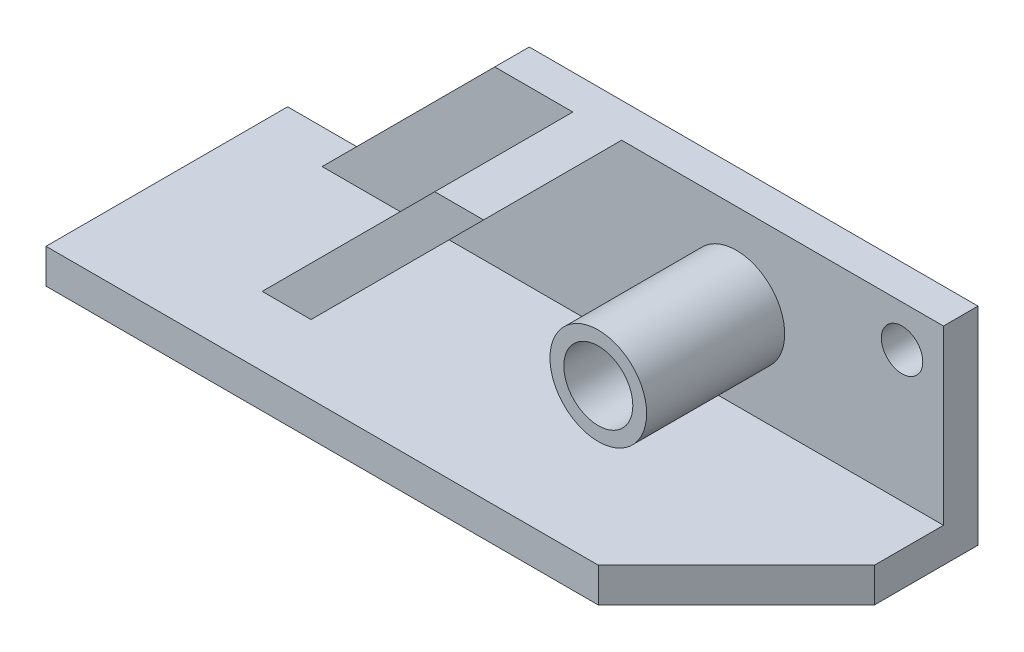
ISO-10303-21;
HEADER;
FILE_DESCRIPTION(('STEP AP214'),'2;1');
FILE_NAME('part.step','',(''),(''),'','','');
FILE_SCHEMA(('AUTOMOTIVE_DESIGN { 1 0 10303 214 1 1 1 1 }'));
ENDSEC;
DATA;
#1=APPLICATION_CONTEXT('core data for automotive mechanical design processes');
#2=APPLICATION_PROTOCOL_DEFINITION('international standard','automotive_design',2000,#1);
#3=PRODUCT_CONTEXT('',#1,'mechanical');
#4=PRODUCT('Part','Part','',(#3));
#5=PRODUCT_RELATED_PRODUCT_CATEGORY('part','',(#4));
#6=PRODUCT_DEFINITION_FORMATION('','',#4);
#7=PRODUCT_DEFINITION_CONTEXT('part definition',#1,'design');
#8=PRODUCT_DEFINITION('design','',#6,#7);
#9=PRODUCT_DEFINITION_SHAPE('','',#8);
#10=(LENGTH_UNIT() NAMED_UNIT(*) SI_UNIT(.MILLI.,.METRE.));
#11=(NAMED_UNIT(*) PLANE_ANGLE_UNIT() SI_UNIT($,.RADIAN.));
#12=(NAMED_UNIT(*) SI_UNIT($,.STERADIAN.) SOLID_ANGLE_UNIT());
#13=UNCERTAINTY_MEASURE_WITH_UNIT(LENGTH_MEASURE(1.E-05),#10,'distance_accuracy_value','');
#14=(GEOMETRIC_REPRESENTATION_CONTEXT(3) GLOBAL_UNCERTAINTY_ASSIGNED_CONTEXT((#13)) GLOBAL_UNIT_ASSIGNED_CONTEXT((#10,
#11,#12)) REPRESENTATION_CONTEXT('',''));
#15=CARTESIAN_POINT('',(0.,0.,0.));
#16=DIRECTION('',(0.,0.,1.));
#17=DIRECTION('',(1.,0.,0.));
#18=AXIS2_PLACEMENT_3D('',#15,#16,#17);
#19=CARTESIAN_POINT('',(100.,94.9999999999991,5.));
#20=DIRECTION('',(0.,0.,-1.));
#21=DIRECTION('',(-1.,0.,0.));
#22=AXIS2_PLACEMENT_3D('',#19,#20,#21);
#23=PLANE('',#22);
#24=CARTESIAN_POINT('',(94.,24.,5.));
#25=DIRECTION('',(0.,0.,1.));
#26=DIRECTION('',(1.,0.,0.));
#27=AXIS2_PLACEMENT_3D('',#24,#25,#26);
#28=CIRCLE('',#27,3.00000000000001);
#29=CARTESIAN_POINT('',(97.,24.,5.));
#30=VERTEX_POINT('',#29);
#31=EDGE_CURVE('E152',#30,#30,#28,.T.);
#32=ORIENTED_EDGE('',*,*,#31,.F.);
#33=EDGE_LOOP('',(#32));
#34=FACE_BOUND('',#33,.T.);
#35=DIRECTION('',(0.707106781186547,0.707106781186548,0.));
#36=VECTOR('',#35,1.);
#37=CARTESIAN_POINT('',(28.3847763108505,5.,5.));
#38=LINE('',#37,#36);
#39=CARTESIAN_POINT('',(28.3847763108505,5.,5.));
#40=VERTEX_POINT('',#39);
#41=CARTESIAN_POINT('',(53.3847763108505,30.,5.));
#42=VERTEX_POINT('',#41);
#43=EDGE_CURVE('E142',#40,#42,#38,.T.);
#44=ORIENTED_EDGE('',*,*,#43,.F.);
#45=DIRECTION('',(1.,0.,0.));
#46=VECTOR('',#45,1.);
#47=CARTESIAN_POINT('',(10.,5.,5.));
#48=LINE('',#47,#46);
#49=CARTESIAN_POINT('',(100.,5.,5.));
#50=VERTEX_POINT('',#49);
#51=EDGE_CURVE('E163',#40,#50,#48,.T.);
#52=ORIENTED_EDGE('',*,*,#51,.T.);
#53=DIRECTION('',(0.,1.,0.));
#54=VECTOR('',#53,1.);
#55=CARTESIAN_POINT('',(100.,5.,5.));
#56=LINE('',#55,#54);
#57=CARTESIAN_POINT('',(100.,30.,5.));
#58=VERTEX_POINT('',#57);
#59=EDGE_CURVE('E132',#50,#58,#56,.T.);
#60=ORIENTED_EDGE('',*,*,#59,.T.);
#61=DIRECTION('',(-1.,0.,0.));
#62=VECTOR('',#61,1.);
#63=CARTESIAN_POINT('',(100.,30.,5.));
#64=LINE('',#63,#62);
#65=EDGE_CURVE('E131',#58,#42,#64,.T.);
#66=ORIENTED_EDGE('',*,*,#65,.T.);
#67=EDGE_LOOP('',(#44,#52,#60,#66));
#68=FACE_BOUND('',#67,.T.);
#69=CARTESIAN_POINT('',(70.,17.5,5.));
#70=DIRECTION('',(0.,0.,-1.));
#71=DIRECTION('',(-1.,0.,0.));
#72=AXIS2_PLACEMENT_3D('',#69,#70,#71);
#73=CIRCLE('',#72,7.);
#74=CARTESIAN_POINT('',(63.,17.5,5.));
#75=VERTEX_POINT('',#74);
#76=EDGE_CURVE('E11',#75,#75,#73,.F.);
#77=ORIENTED_EDGE('',*,*,#76,.F.);
#78=EDGE_LOOP('',(#77));
#79=FACE_BOUND('',#78,.T.);
#80=ADVANCED_FACE('F33',(#34,#68,#79),#23,.F.);
#81=CARTESIAN_POINT('',(0.,5.,0.));
#82=DIRECTION('',(0.,-1.,0.));
#83=DIRECTION('',(0.,0.,-1.));
#84=AXIS2_PLACEMENT_3D('',#81,#82,#83);
#85=PLANE('',#84);
#86=DIRECTION('',(0.,0.,-1.));
#87=VECTOR('',#86,1.);
#88=CARTESIAN_POINT('',(21.313708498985,5.,25.));
#89=LINE('',#88,#87);
#90=CARTESIAN_POINT('',(21.313708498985,5.,25.));
#91=VERTEX_POINT('',#90);
#92=CARTESIAN_POINT('',(21.313708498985,5.,5.));
#93=VERTEX_POINT('',#92);
#94=EDGE_CURVE('E149',#91,#93,#89,.T.);
#95=ORIENTED_EDGE('',*,*,#94,.T.);
#96=CARTESIAN_POINT('',(10.,5.,5.));
#97=VERTEX_POINT('',#96);
#98=EDGE_CURVE('E139',#97,#93,#48,.T.);
#99=ORIENTED_EDGE('',*,*,#98,.F.);
#100=DIRECTION('',(0.,0.,-1.));
#101=VECTOR('',#100,1.);
#102=CARTESIAN_POINT('',(10.,5.,5.));
#103=LINE('',#102,#101);
#104=CARTESIAN_POINT('',(10.,5.,0.));
#105=VERTEX_POINT('',#104);
#106=EDGE_CURVE('E169',#97,#105,#103,.T.);
#107=ORIENTED_EDGE('',*,*,#106,.T.);
#108=DIRECTION('',(-1.,0.,0.));
#109=VECTOR('',#108,1.);
#110=CARTESIAN_POINT('',(0.,5.,0.));
#111=LINE('',#110,#109);
#112=CARTESIAN_POINT('',(0.,5.,0.));
#113=VERTEX_POINT('',#112);
#114=EDGE_CURVE('E202',#105,#113,#111,.T.);
#115=ORIENTED_EDGE('',*,*,#114,.T.);
#116=DIRECTION('',(0.,0.,1.));
#117=VECTOR('',#116,1.);
#118=CARTESIAN_POINT('',(0.,5.,35.));
#119=LINE('',#118,#117);
#120=CARTESIAN_POINT('',(0.,5.,35.));
#121=VERTEX_POINT('',#120);
#122=EDGE_CURVE('E247',#113,#121,#119,.T.);
#123=ORIENTED_EDGE('',*,*,#122,.T.);
#124=DIRECTION('',(1.,0.,0.));
#125=VECTOR('',#124,1.);
#126=CARTESIAN_POINT('',(80.,5.,35.));
#127=LINE('',#126,#125);
#128=CARTESIAN_POINT('',(80.,5.,35.));
#129=VERTEX_POINT('',#128);
#130=EDGE_CURVE('E206',#121,#129,#127,.T.);
#131=ORIENTED_EDGE('',*,*,#130,.T.);
#132=DIRECTION('',(0.707106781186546,0.,-0.707106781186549));
#133=VECTOR('',#132,1.);
#134=CARTESIAN_POINT('',(100.,5.,14.9999999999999));
#135=LINE('',#134,#133);
#136=CARTESIAN_POINT('',(100.,5.,14.9999999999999));
#137=VERTEX_POINT('',#136);
#138=EDGE_CURVE('E200',#129,#137,#135,.T.);
#139=ORIENTED_EDGE('',*,*,#138,.T.);
#140=DIRECTION('',(0.,0.,-1.));
#141=VECTOR('',#140,1.);
#142=CARTESIAN_POINT('',(100.,5.,0.));
#143=LINE('',#142,#141);
#144=EDGE_CURVE('E196',#137,#50,#143,.T.);
#145=ORIENTED_EDGE('',*,*,#144,.T.);
#146=ORIENTED_EDGE('',*,*,#51,.F.);
#147=DIRECTION('',(0.,0.,-1.));
#148=VECTOR('',#147,1.);
#149=CARTESIAN_POINT('',(28.3847763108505,5.,25.));
#150=LINE('',#149,#148);
#151=CARTESIAN_POINT('',(28.3847763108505,5.,25.));
#152=VERTEX_POINT('',#151);
#153=EDGE_CURVE('E48',#152,#40,#150,.T.);
#154=ORIENTED_EDGE('',*,*,#153,.F.);
#155=DIRECTION('',(1.,0.,0.));
#156=VECTOR('',#155,1.);
#157=CARTESIAN_POINT('',(21.313708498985,5.,25.));
#158=LINE('',#157,#156);
#159=EDGE_CURVE('E52',#91,#152,#158,.T.);
#160=ORIENTED_EDGE('',*,*,#159,.F.);
#161=EDGE_LOOP('',(#95,#99,#107,#115,#123,#131,#139,#145,#146,#154,#160));
#162=FACE_BOUND('',#161,.T.);
#163=ADVANCED_FACE('F198',(#162),#85,.F.);
#164=DIRECTION('',(-0.707106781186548,-0.707106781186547,0.));
#165=VECTOR('',#164,1.);
#166=CARTESIAN_POINT('',(46.313708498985,30.,5.));
#167=LINE('',#166,#165);
#168=CARTESIAN_POINT('',(46.313708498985,30.,5.));
#169=VERTEX_POINT('',#168);
#170=EDGE_CURVE('E136',#169,#93,#167,.T.);
#171=ORIENTED_EDGE('',*,*,#170,.F.);
#172=CARTESIAN_POINT('',(35.0000000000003,30.,5.));
#173=VERTEX_POINT('',#172);
#174=EDGE_CURVE('E121',#169,#173,#64,.T.);
#175=ORIENTED_EDGE('',*,*,#174,.T.);
#176=DIRECTION('',(-0.707106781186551,-0.707106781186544,0.));
#177=VECTOR('',#176,1.);
#178=CARTESIAN_POINT('',(35.0000000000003,30.,5.));
#179=LINE('',#178,#177);
#180=EDGE_CURVE('E162',#173,#97,#179,.T.);
#181=ORIENTED_EDGE('',*,*,#180,.T.);
#182=ORIENTED_EDGE('',*,*,#98,.T.);
#183=EDGE_LOOP('',(#171,#175,#181,#182));
#184=FACE_BOUND('',#183,.T.);
#185=ADVANCED_FACE('F137',(#184),#23,.F.);
#186=CARTESIAN_POINT('',(0.,5.,35.));
#187=DIRECTION('',(1.,0.,0.));
#188=DIRECTION('',(0.,0.,-1.));
#189=AXIS2_PLACEMENT_3D('',#186,#187,#188);
#190=PLANE('',#189);
#191=DIRECTION('',(0.,0.,1.));
#192=VECTOR('',#191,1.);
#193=CARTESIAN_POINT('',(0.,0.,35.));
#194=LINE('',#193,#192);
#195=CARTESIAN_POINT('',(0.,0.,0.));
#196=VERTEX_POINT('',#195);
#197=CARTESIAN_POINT('',(0.,0.,35.));
#198=VERTEX_POINT('',#197);
#199=EDGE_CURVE('E172',#196,#198,#194,.T.);
#200=ORIENTED_EDGE('',*,*,#199,.T.);
#201=DIRECTION('',(0.,-1.,0.));
#202=VECTOR('',#201,1.);
#203=CARTESIAN_POINT('',(0.,5.,35.));
#204=LINE('',#203,#202);
#205=EDGE_CURVE('E41',#121,#198,#204,.T.);
#206=ORIENTED_EDGE('',*,*,#205,.F.);
#207=ORIENTED_EDGE('',*,*,#122,.F.);
#208=DIRECTION('',(0.,-1.,0.));
#209=VECTOR('',#208,1.);
#210=CARTESIAN_POINT('',(0.,5.,0.));
#211=LINE('',#210,#209);
#212=EDGE_CURVE('E204',#113,#196,#211,.T.);
#213=ORIENTED_EDGE('',*,*,#212,.T.);
#214=EDGE_LOOP('',(#200,#206,#207,#213));
#215=FACE_BOUND('',#214,.T.);
#216=ADVANCED_FACE('F35',(#215),#190,.F.);
#217=CARTESIAN_POINT('',(80.,5.,35.));
#218=DIRECTION('',(0.,0.,-1.));
#219=DIRECTION('',(-1.,0.,0.));
#220=AXIS2_PLACEMENT_3D('',#217,#218,#219);
#221=PLANE('',#220);
#222=DIRECTION('',(1.,0.,0.));
#223=VECTOR('',#222,1.);
#224=CARTESIAN_POINT('',(80.,0.,35.));
#225=LINE('',#224,#223);
#226=CARTESIAN_POINT('',(80.,0.,35.));
#227=VERTEX_POINT('',#226);
#228=EDGE_CURVE('E232',#198,#227,#225,.T.);
#229=ORIENTED_EDGE('',*,*,#228,.T.);
#230=DIRECTION('',(0.,-1.,0.));
#231=VECTOR('',#230,1.);
#232=CARTESIAN_POINT('',(80.,5.,35.));
#233=LINE('',#232,#231);
#234=EDGE_CURVE('E222',#129,#227,#233,.T.);
#235=ORIENTED_EDGE('',*,*,#234,.F.);
#236=ORIENTED_EDGE('',*,*,#130,.F.);
#237=ORIENTED_EDGE('',*,*,#205,.T.);
#238=EDGE_LOOP('',(#229,#235,#236,#237));
#239=FACE_BOUND('',#238,.T.);
#240=ADVANCED_FACE('F231',(#239),#221,.F.);
#241=CARTESIAN_POINT('',(100.,5.,14.9999999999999));
#242=DIRECTION('',(-0.707106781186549,0.,-0.707106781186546));
#243=DIRECTION('',(-0.707106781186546,0.,0.707106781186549));
#244=AXIS2_PLACEMENT_3D('',#241,#242,#243);
#245=PLANE('',#244);
#246=DIRECTION('',(0.707106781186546,0.,-0.707106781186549));
#247=VECTOR('',#246,1.);
#248=CARTESIAN_POINT('',(100.,0.,14.9999999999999));
#249=LINE('',#248,#247);
#250=CARTESIAN_POINT('',(100.,0.,14.9999999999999));
#251=VERTEX_POINT('',#250);
#252=EDGE_CURVE('E240',#227,#251,#249,.T.);
#253=ORIENTED_EDGE('',*,*,#252,.T.);
#254=DIRECTION('',(0.,-1.,0.));
#255=VECTOR('',#254,1.);
#256=CARTESIAN_POINT('',(100.,5.,14.9999999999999));
#257=LINE('',#256,#255);
#258=EDGE_CURVE('E221',#137,#251,#257,.T.);
#259=ORIENTED_EDGE('',*,*,#258,.F.);
#260=ORIENTED_EDGE('',*,*,#138,.F.);
#261=ORIENTED_EDGE('',*,*,#234,.T.);
#262=EDGE_LOOP('',(#253,#259,#260,#261));
#263=FACE_BOUND('',#262,.T.);
#264=ADVANCED_FACE('F248',(#263),#245,.F.);
#265=CARTESIAN_POINT('',(100.,5.,0.));
#266=DIRECTION('',(-1.,0.,0.));
#267=DIRECTION('',(0.,0.,1.));
#268=AXIS2_PLACEMENT_3D('',#265,#266,#267);
#269=PLANE('',#268);
#270=DIRECTION('',(0.,0.,-1.));
#271=VECTOR('',#270,1.);
#272=CARTESIAN_POINT('',(100.,0.,0.));
#273=LINE('',#272,#271);
#274=CARTESIAN_POINT('',(100.,0.,0.));
#275=VERTEX_POINT('',#274);
#276=EDGE_CURVE('E241',#251,#275,#273,.T.);
#277=ORIENTED_EDGE('',*,*,#276,.T.);
#278=DIRECTION('',(0.,-1.,0.));
#279=VECTOR('',#278,1.);
#280=CARTESIAN_POINT('',(100.,5.,0.));
#281=LINE('',#280,#279);
#282=CARTESIAN_POINT('',(100.,30.,0.));
#283=VERTEX_POINT('',#282);
#284=EDGE_CURVE('E218',#283,#275,#281,.T.);
#285=ORIENTED_EDGE('',*,*,#284,.F.);
#286=DIRECTION('',(0.,0.,-1.));
#287=VECTOR('',#286,1.);
#288=CARTESIAN_POINT('',(100.,30.,5.));
#289=LINE('',#288,#287);
#290=EDGE_CURVE('E166',#58,#283,#289,.T.);
#291=ORIENTED_EDGE('',*,*,#290,.F.);
#292=ORIENTED_EDGE('',*,*,#59,.F.);
#293=ORIENTED_EDGE('',*,*,#144,.F.);
#294=ORIENTED_EDGE('',*,*,#258,.T.);
#295=EDGE_LOOP('',(#277,#285,#291,#292,#293,#294));
#296=FACE_BOUND('',#295,.T.);
#297=ADVANCED_FACE('F194',(#296),#269,.F.);
#298=CARTESIAN_POINT('',(0.,5.,0.));
#299=DIRECTION('',(0.,0.,1.));
#300=DIRECTION('',(1.,0.,0.));
#301=AXIS2_PLACEMENT_3D('',#298,#299,#300);
#302=PLANE('',#301);
#303=DIRECTION('',(-1.,0.,0.));
#304=VECTOR('',#303,1.);
#305=CARTESIAN_POINT('',(0.,0.,0.));
#306=LINE('',#305,#304);
#307=EDGE_CURVE('E245',#275,#196,#306,.T.);
#308=ORIENTED_EDGE('',*,*,#307,.T.);
#309=ORIENTED_EDGE('',*,*,#212,.F.);
#310=ORIENTED_EDGE('',*,*,#114,.F.);
#311=DIRECTION('',(-0.707106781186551,-0.707106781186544,0.));
#312=VECTOR('',#311,1.);
#313=CARTESIAN_POINT('',(35.0000000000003,30.,0.));
#314=LINE('',#313,#312);
#315=CARTESIAN_POINT('',(35.0000000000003,30.,0.));
#316=VERTEX_POINT('',#315);
#317=EDGE_CURVE('E159',#316,#105,#314,.T.);
#318=ORIENTED_EDGE('',*,*,#317,.F.);
#319=DIRECTION('',(-1.,0.,0.));
#320=VECTOR('',#319,1.);
#321=CARTESIAN_POINT('',(100.,30.,0.));
#322=LINE('',#321,#320);
#323=EDGE_CURVE('E160',#283,#316,#322,.T.);
#324=ORIENTED_EDGE('',*,*,#323,.F.);
#325=ORIENTED_EDGE('',*,*,#284,.T.);
#326=EDGE_LOOP('',(#308,#309,#310,#318,#324,#325));
#327=FACE_BOUND('',#326,.T.);
#328=CARTESIAN_POINT('',(94.,24.,0.));
#329=DIRECTION('',(0.,0.,1.));
#330=DIRECTION('',(1.,0.,0.));
#331=AXIS2_PLACEMENT_3D('',#328,#329,#330);
#332=CIRCLE('',#331,3.00000000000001);
#333=CARTESIAN_POINT('',(97.,24.,0.));
#334=VERTEX_POINT('',#333);
#335=EDGE_CURVE('E148',#334,#334,#332,.T.);
#336=ORIENTED_EDGE('',*,*,#335,.T.);
#337=EDGE_LOOP('',(#336));
#338=FACE_BOUND('',#337,.T.);
#339=ADVANCED_FACE('F252',(#327,#338),#302,.F.);
#340=CARTESIAN_POINT('',(0.,0.,0.));
#341=DIRECTION('',(0.,-1.,0.));
#342=DIRECTION('',(0.,0.,-1.));
#343=AXIS2_PLACEMENT_3D('',#340,#341,#342);
#344=PLANE('',#343);
#345=ORIENTED_EDGE('',*,*,#199,.F.);
#346=ORIENTED_EDGE('',*,*,#307,.F.);
#347=ORIENTED_EDGE('',*,*,#276,.F.);
#348=ORIENTED_EDGE('',*,*,#252,.F.);
#349=ORIENTED_EDGE('',*,*,#228,.F.);
#350=EDGE_LOOP('',(#345,#346,#347,#348,#349));
#351=FACE_BOUND('',#350,.T.);
#352=ADVANCED_FACE('F250',(#351),#344,.T.);
#353=CARTESIAN_POINT('',(35.0000000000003,30.,5.));
#354=DIRECTION('',(0.707106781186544,-0.707106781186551,0.));
#355=DIRECTION('',(0.707106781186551,0.707106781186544,0.));
#356=AXIS2_PLACEMENT_3D('',#353,#354,#355);
#357=PLANE('',#356);
#358=ORIENTED_EDGE('',*,*,#317,.T.);
#359=ORIENTED_EDGE('',*,*,#106,.F.);
#360=ORIENTED_EDGE('',*,*,#180,.F.);
#361=DIRECTION('',(0.,0.,-1.));
#362=VECTOR('',#361,1.);
#363=CARTESIAN_POINT('',(35.0000000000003,30.,5.));
#364=LINE('',#363,#362);
#365=EDGE_CURVE('E128',#173,#316,#364,.T.);
#366=ORIENTED_EDGE('',*,*,#365,.T.);
#367=EDGE_LOOP('',(#358,#359,#360,#366));
#368=FACE_BOUND('',#367,.T.);
#369=ADVANCED_FACE('F276',(#368),#357,.F.);
#370=CARTESIAN_POINT('',(100.,30.,5.));
#371=DIRECTION('',(0.,-1.,0.));
#372=DIRECTION('',(1.,0.,0.));
#373=AXIS2_PLACEMENT_3D('',#370,#371,#372);
#374=PLANE('',#373);
#375=ORIENTED_EDGE('',*,*,#323,.T.);
#376=ORIENTED_EDGE('',*,*,#365,.F.);
#377=ORIENTED_EDGE('',*,*,#174,.F.);
#378=DIRECTION('',(0.,0.,-1.));
#379=VECTOR('',#378,1.);
#380=CARTESIAN_POINT('',(46.313708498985,30.,25.));
#381=LINE('',#380,#379);
#382=CARTESIAN_POINT('',(46.313708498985,30.,25.));
#383=VERTEX_POINT('',#382);
#384=EDGE_CURVE('E126',#383,#169,#381,.T.);
#385=ORIENTED_EDGE('',*,*,#384,.F.);
#386=DIRECTION('',(-1.,0.,0.));
#387=VECTOR('',#386,1.);
#388=CARTESIAN_POINT('',(53.3847763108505,30.,25.));
#389=LINE('',#388,#387);
#390=CARTESIAN_POINT('',(53.3847763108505,30.,25.));
#391=VERTEX_POINT('',#390);
#392=EDGE_CURVE('E263',#391,#383,#389,.T.);
#393=ORIENTED_EDGE('',*,*,#392,.F.);
#394=DIRECTION('',(0.,0.,-1.));
#395=VECTOR('',#394,1.);
#396=CARTESIAN_POINT('',(53.3847763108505,30.,25.));
#397=LINE('',#396,#395);
#398=EDGE_CURVE('E259',#391,#42,#397,.T.);
#399=ORIENTED_EDGE('',*,*,#398,.T.);
#400=ORIENTED_EDGE('',*,*,#65,.F.);
#401=ORIENTED_EDGE('',*,*,#290,.T.);
#402=EDGE_LOOP('',(#375,#376,#377,#385,#393,#399,#400,#401));
#403=FACE_BOUND('',#402,.T.);
#404=ADVANCED_FACE('F123',(#403),#374,.F.);
#405=CARTESIAN_POINT('',(94.,24.,5.));
#406=DIRECTION('',(0.,0.,-1.));
#407=DIRECTION('',(-1.,0.,0.));
#408=AXIS2_PLACEMENT_3D('',#405,#406,#407);
#409=CYLINDRICAL_SURFACE('',#408,3.00000000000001);
#410=ORIENTED_EDGE('',*,*,#31,.T.);
#411=EDGE_LOOP('',(#410));
#412=FACE_BOUND('',#411,.T.);
#413=ORIENTED_EDGE('',*,*,#335,.F.);
#414=EDGE_LOOP('',(#413));
#415=FACE_BOUND('',#414,.T.);
#416=ADVANCED_FACE('F283',(#412,#415),#409,.F.);
#417=CARTESIAN_POINT('',(46.313708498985,30.,25.));
#418=DIRECTION('',(0.707106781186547,-0.707106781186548,0.));
#419=DIRECTION('',(0.707106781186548,0.707106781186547,0.));
#420=AXIS2_PLACEMENT_3D('',#417,#418,#419);
#421=PLANE('',#420);
#422=ORIENTED_EDGE('',*,*,#170,.T.);
#423=ORIENTED_EDGE('',*,*,#94,.F.);
#424=DIRECTION('',(-0.707106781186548,-0.707106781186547,0.));
#425=VECTOR('',#424,1.);
#426=CARTESIAN_POINT('',(46.313708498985,30.,25.));
#427=LINE('',#426,#425);
#428=EDGE_CURVE('E146',#383,#91,#427,.T.);
#429=ORIENTED_EDGE('',*,*,#428,.F.);
#430=ORIENTED_EDGE('',*,*,#384,.T.);
#431=EDGE_LOOP('',(#422,#423,#429,#430));
#432=FACE_BOUND('',#431,.T.);
#433=ADVANCED_FACE('F145',(#432),#421,.F.);
#434=CARTESIAN_POINT('',(28.3847763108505,5.,25.));
#435=DIRECTION('',(-0.707106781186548,0.707106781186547,0.));
#436=DIRECTION('',(-0.707106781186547,-0.707106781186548,0.));
#437=AXIS2_PLACEMENT_3D('',#434,#435,#436);
#438=PLANE('',#437);
#439=ORIENTED_EDGE('',*,*,#43,.T.);
#440=ORIENTED_EDGE('',*,*,#398,.F.);
#441=DIRECTION('',(0.707106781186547,0.707106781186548,0.));
#442=VECTOR('',#441,1.);
#443=CARTESIAN_POINT('',(28.3847763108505,5.,25.));
#444=LINE('',#443,#442);
#445=EDGE_CURVE('E270',#152,#391,#444,.T.);
#446=ORIENTED_EDGE('',*,*,#445,.F.);
#447=ORIENTED_EDGE('',*,*,#153,.T.);
#448=EDGE_LOOP('',(#439,#440,#446,#447));
#449=FACE_BOUND('',#448,.T.);
#450=ADVANCED_FACE('F261',(#449),#438,.F.);
#451=CARTESIAN_POINT('',(53.3847763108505,30.,25.));
#452=DIRECTION('',(0.,0.,-1.));
#453=DIRECTION('',(-1.,0.,0.));
#454=AXIS2_PLACEMENT_3D('',#451,#452,#453);
#455=PLANE('',#454);
#456=ORIENTED_EDGE('',*,*,#392,.T.);
#457=ORIENTED_EDGE('',*,*,#428,.T.);
#458=ORIENTED_EDGE('',*,*,#159,.T.);
#459=ORIENTED_EDGE('',*,*,#445,.T.);
#460=EDGE_LOOP('',(#456,#457,#458,#459));
#461=FACE_BOUND('',#460,.T.);
#462=ADVANCED_FACE('F273',(#461),#455,.F.);
#463=CARTESIAN_POINT('',(70.,17.5,25.));
#464=DIRECTION('',(0.,0.,1.));
#465=DIRECTION('',(1.,0.,0.));
#466=AXIS2_PLACEMENT_3D('',#463,#464,#465);
#467=PLANE('',#466);
#468=CARTESIAN_POINT('',(70.,17.5,25.));
#469=DIRECTION('',(0.,0.,1.));
#470=DIRECTION('',(1.,0.,0.));
#471=AXIS2_PLACEMENT_3D('',#468,#469,#470);
#472=CIRCLE('',#471,7.);
#473=CARTESIAN_POINT('',(77.,17.5,25.));
#474=VERTEX_POINT('',#473);
#475=EDGE_CURVE('E143',#474,#474,#472,.T.);
#476=ORIENTED_EDGE('',*,*,#475,.T.);
#477=EDGE_LOOP('',(#476));
#478=FACE_BOUND('',#477,.T.);
#479=CARTESIAN_POINT('',(70.,17.5,25.));
#480=DIRECTION('',(0.,0.,1.));
#481=DIRECTION('',(1.,0.,0.));
#482=AXIS2_PLACEMENT_3D('',#479,#480,#481);
#483=CIRCLE('',#482,5.);
#484=CARTESIAN_POINT('',(75.,17.5,25.));
#485=VERTEX_POINT('',#484);
#486=EDGE_CURVE('E437',#485,#485,#483,.T.);
#487=ORIENTED_EDGE('',*,*,#486,.F.);
#488=EDGE_LOOP('',(#487));
#489=FACE_BOUND('',#488,.T.);
#490=ADVANCED_FACE('F402',(#478,#489),#467,.T.);
#491=CARTESIAN_POINT('',(70.,17.5,25.));
#492=DIRECTION('',(0.,0.,-1.));
#493=DIRECTION('',(-1.,0.,0.));
#494=AXIS2_PLACEMENT_3D('',#491,#492,#493);
#495=CYLINDRICAL_SURFACE('',#494,7.);
#496=ORIENTED_EDGE('',*,*,#475,.F.);
#497=EDGE_LOOP('',(#496));
#498=FACE_BOUND('',#497,.T.);
#499=ORIENTED_EDGE('',*,*,#76,.T.);
#500=EDGE_LOOP('',(#499));
#501=FACE_BOUND('',#500,.T.);
#502=ADVANCED_FACE('F411',(#498,#501),#495,.T.);
#503=CARTESIAN_POINT('',(70.,17.5,25.));
#504=DIRECTION('',(0.,0.,-1.));
#505=DIRECTION('',(-1.,0.,0.));
#506=AXIS2_PLACEMENT_3D('',#503,#504,#505);
#507=CYLINDRICAL_SURFACE('',#506,5.);
#508=ORIENTED_EDGE('',*,*,#486,.T.);
#509=EDGE_LOOP('',(#508));
#510=FACE_BOUND('',#509,.T.);
#511=CARTESIAN_POINT('',(70.,17.5,5.));
#512=DIRECTION('',(0.,0.,1.));
#513=DIRECTION('',(1.,0.,0.));
#514=AXIS2_PLACEMENT_3D('',#511,#512,#513);
#515=CIRCLE('',#514,5.);
#516=CARTESIAN_POINT('',(75.,17.5,5.));
#517=VERTEX_POINT('',#516);
#518=EDGE_CURVE('E440',#517,#517,#515,.T.);
#519=ORIENTED_EDGE('',*,*,#518,.F.);
#520=EDGE_LOOP('',(#519));
#521=FACE_BOUND('',#520,.T.);
#522=ADVANCED_FACE('F297',(#510,#521),#507,.F.);
#523=ORIENTED_EDGE('',*,*,#518,.T.);
#524=EDGE_LOOP('',(#523));
#525=FACE_BOUND('',#524,.T.);
#526=ADVANCED_FACE('F289',(#525),#23,.F.);
#527=CLOSED_SHELL('',(#80,#163,#185,#216,#240,#264,#297,#339,#352,#369,#404,#416,#433,#450,#462,
#490,#502,#522,#526));
#528=MANIFOLD_SOLID_BREP('B2',#527);
#529=ADVANCED_BREP_SHAPE_REPRESENTATION('',(#18,#528),#14);
#530=SHAPE_DEFINITION_REPRESENTATION(#9,#529);
ENDSEC;
END-ISO-10303-21;
